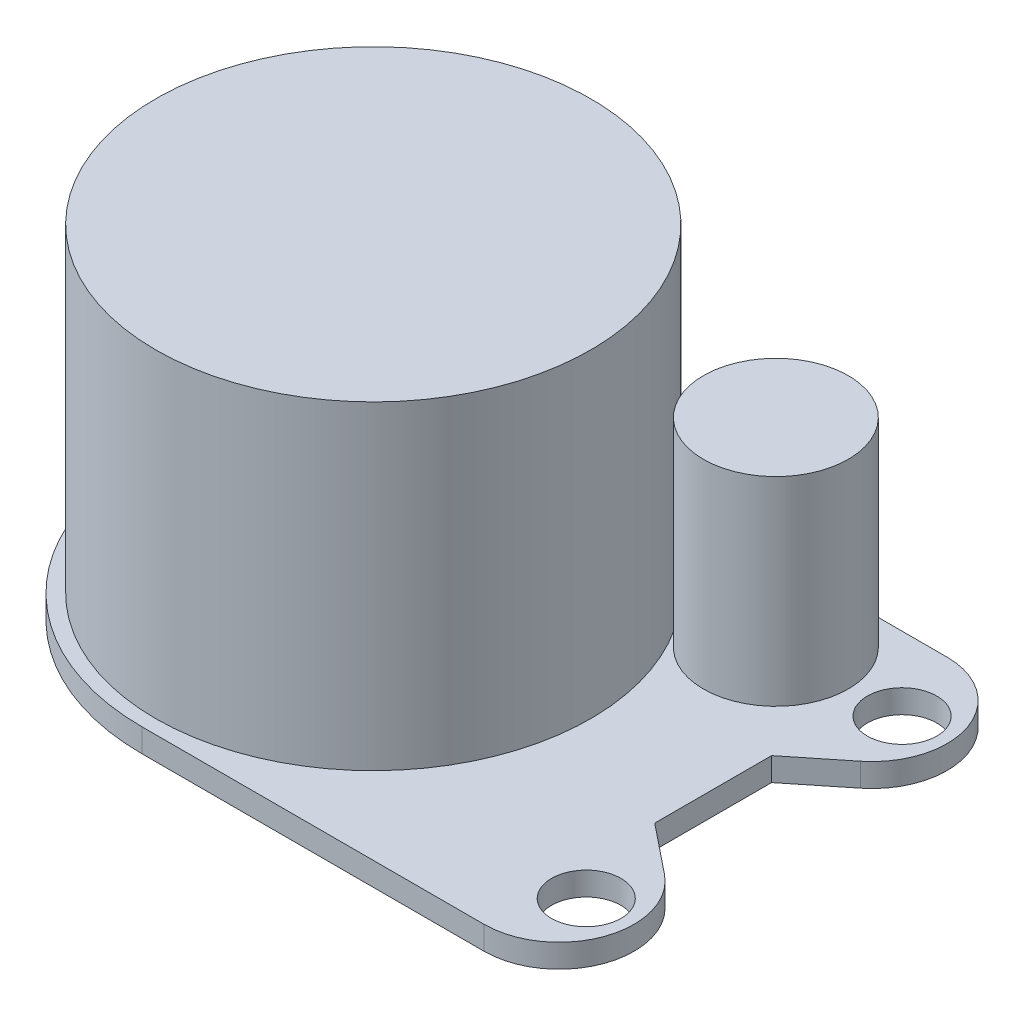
ISO-10303-21;
HEADER;
FILE_DESCRIPTION(('STEP AP214'),'2;1');
FILE_NAME('part.step','',(''),(''),'','','');
FILE_SCHEMA(('AUTOMOTIVE_DESIGN { 1 0 10303 214 1 1 1 1 }'));
ENDSEC;
DATA;
#1=APPLICATION_CONTEXT('core data for automotive mechanical design processes');
#2=APPLICATION_PROTOCOL_DEFINITION('international standard','automotive_design',2000,#1);
#3=PRODUCT_CONTEXT('',#1,'mechanical');
#4=PRODUCT('Part','Part','',(#3));
#5=PRODUCT_RELATED_PRODUCT_CATEGORY('part','',(#4));
#6=PRODUCT_DEFINITION_FORMATION('','',#4);
#7=PRODUCT_DEFINITION_CONTEXT('part definition',#1,'design');
#8=PRODUCT_DEFINITION('design','',#6,#7);
#9=PRODUCT_DEFINITION_SHAPE('','',#8);
#10=(LENGTH_UNIT() NAMED_UNIT(*) SI_UNIT(.MILLI.,.METRE.));
#11=(NAMED_UNIT(*) PLANE_ANGLE_UNIT() SI_UNIT($,.RADIAN.));
#12=(NAMED_UNIT(*) SI_UNIT($,.STERADIAN.) SOLID_ANGLE_UNIT());
#13=UNCERTAINTY_MEASURE_WITH_UNIT(LENGTH_MEASURE(1.E-05),#10,'distance_accuracy_value','');
#14=(GEOMETRIC_REPRESENTATION_CONTEXT(3) GLOBAL_UNCERTAINTY_ASSIGNED_CONTEXT((#13)) GLOBAL_UNIT_ASSIGNED_CONTEXT((#10,
#11,#12)) REPRESENTATION_CONTEXT('',''));
#15=CARTESIAN_POINT('',(0.,0.,0.));
#16=DIRECTION('',(0.,0.,1.));
#17=DIRECTION('',(1.,0.,0.));
#18=AXIS2_PLACEMENT_3D('',#15,#16,#17);
#19=CARTESIAN_POINT('',(-13.9330413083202,1.,-10.3038009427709));
#20=DIRECTION('',(0.,-1.,0.));
#21=DIRECTION('',(0.,0.,-1.));
#22=AXIS2_PLACEMENT_3D('',#19,#20,#21);
#23=CYLINDRICAL_SURFACE('',#22,3.20594155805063);
#24=CARTESIAN_POINT('',(-13.9330413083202,0.,-10.3038009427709));
#25=DIRECTION('',(0.,1.,0.));
#26=DIRECTION('',(0.,0.,1.));
#27=AXIS2_PLACEMENT_3D('',#24,#25,#26);
#28=CIRCLE('',#27,3.20594155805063);
#29=CARTESIAN_POINT('',(-11.9265456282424,0.,-7.80339370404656));
#30=VERTEX_POINT('',#29);
#31=CARTESIAN_POINT('',(-13.9330413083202,0.,-13.5097425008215));
#32=VERTEX_POINT('',#31);
#33=EDGE_CURVE('E149',#30,#32,#28,.T.);
#34=ORIENTED_EDGE('',*,*,#33,.T.);
#35=DIRECTION('',(0.,-1.,0.));
#36=VECTOR('',#35,1.);
#37=CARTESIAN_POINT('',(-13.9330413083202,1.,-13.5097425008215));
#38=LINE('',#37,#36);
#39=CARTESIAN_POINT('',(-13.9330413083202,1.,-13.5097425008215));
#40=VERTEX_POINT('',#39);
#41=EDGE_CURVE('E55',#40,#32,#38,.T.);
#42=ORIENTED_EDGE('',*,*,#41,.F.);
#43=CARTESIAN_POINT('',(-13.9330413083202,1.,-10.3038009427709));
#44=DIRECTION('',(0.,1.,0.));
#45=DIRECTION('',(0.,0.,1.));
#46=AXIS2_PLACEMENT_3D('',#43,#44,#45);
#47=CIRCLE('',#46,3.20594155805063);
#48=CARTESIAN_POINT('',(-11.9265456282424,1.,-7.80339370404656));
#49=VERTEX_POINT('',#48);
#50=EDGE_CURVE('E172',#49,#40,#47,.T.);
#51=ORIENTED_EDGE('',*,*,#50,.F.);
#52=DIRECTION('',(0.,-1.,0.));
#53=VECTOR('',#52,1.);
#54=CARTESIAN_POINT('',(-11.9265456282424,1.,-7.80339370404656));
#55=LINE('',#54,#53);
#56=EDGE_CURVE('E145',#49,#30,#55,.T.);
#57=ORIENTED_EDGE('',*,*,#56,.T.);
#58=EDGE_LOOP('',(#34,#42,#51,#57));
#59=FACE_BOUND('',#58,.T.);
#60=ADVANCED_FACE('F45',(#59),#23,.T.);
#61=CARTESIAN_POINT('',(-13.9330413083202,1.,-13.5097425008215));
#62=DIRECTION('',(0.,0.,1.));
#63=DIRECTION('',(1.,0.,0.));
#64=AXIS2_PLACEMENT_3D('',#61,#62,#63);
#65=PLANE('',#64);
#66=DIRECTION('',(-1.,0.,0.));
#67=VECTOR('',#66,1.);
#68=CARTESIAN_POINT('',(-13.9330413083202,0.,-13.5097425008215));
#69=LINE('',#68,#67);
#70=CARTESIAN_POINT('',(-28.5770997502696,0.,-13.5097425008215));
#71=VERTEX_POINT('',#70);
#72=EDGE_CURVE('E153',#32,#71,#69,.T.);
#73=ORIENTED_EDGE('',*,*,#72,.T.);
#74=DIRECTION('',(0.,-1.,0.));
#75=VECTOR('',#74,1.);
#76=CARTESIAN_POINT('',(-28.5770997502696,1.,-13.5097425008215));
#77=LINE('',#76,#75);
#78=CARTESIAN_POINT('',(-28.5770997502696,1.,-13.5097425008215));
#79=VERTEX_POINT('',#78);
#80=EDGE_CURVE('E187',#79,#71,#77,.T.);
#81=ORIENTED_EDGE('',*,*,#80,.F.);
#82=DIRECTION('',(-1.,0.,0.));
#83=VECTOR('',#82,1.);
#84=CARTESIAN_POINT('',(-13.9330413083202,1.,-13.5097425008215));
#85=LINE('',#84,#83);
#86=EDGE_CURVE('E108',#40,#79,#85,.T.);
#87=ORIENTED_EDGE('',*,*,#86,.F.);
#88=ORIENTED_EDGE('',*,*,#41,.T.);
#89=EDGE_LOOP('',(#73,#81,#87,#88));
#90=FACE_BOUND('',#89,.T.);
#91=ADVANCED_FACE('F260',(#90),#65,.F.);
#92=CARTESIAN_POINT('',(-28.5770997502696,1.,-3.60974250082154));
#93=DIRECTION('',(0.,-1.,0.));
#94=DIRECTION('',(0.,0.,-1.));
#95=AXIS2_PLACEMENT_3D('',#92,#93,#94);
#96=CYLINDRICAL_SURFACE('',#95,9.9);
#97=CARTESIAN_POINT('',(-28.5770997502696,0.,-3.60974250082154));
#98=DIRECTION('',(0.,1.,0.));
#99=DIRECTION('',(0.,0.,1.));
#100=AXIS2_PLACEMENT_3D('',#97,#98,#99);
#101=CIRCLE('',#100,9.9);
#102=CARTESIAN_POINT('',(-28.5770997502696,0.,6.29025749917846));
#103=VERTEX_POINT('',#102);
#104=EDGE_CURVE('E157',#71,#103,#101,.T.);
#105=ORIENTED_EDGE('',*,*,#104,.T.);
#106=DIRECTION('',(0.,-1.,0.));
#107=VECTOR('',#106,1.);
#108=CARTESIAN_POINT('',(-28.5770997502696,1.,6.29025749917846));
#109=LINE('',#108,#107);
#110=CARTESIAN_POINT('',(-28.5770997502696,1.,6.29025749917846));
#111=VERTEX_POINT('',#110);
#112=EDGE_CURVE('E183',#111,#103,#109,.T.);
#113=ORIENTED_EDGE('',*,*,#112,.F.);
#114=CARTESIAN_POINT('',(-28.5770997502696,1.,-3.60974250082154));
#115=DIRECTION('',(0.,1.,0.));
#116=DIRECTION('',(0.,0.,1.));
#117=AXIS2_PLACEMENT_3D('',#114,#115,#116);
#118=CIRCLE('',#117,9.9);
#119=EDGE_CURVE('E225',#79,#111,#118,.T.);
#120=ORIENTED_EDGE('',*,*,#119,.F.);
#121=ORIENTED_EDGE('',*,*,#80,.T.);
#122=EDGE_LOOP('',(#105,#113,#120,#121));
#123=FACE_BOUND('',#122,.T.);
#124=ADVANCED_FACE('F264',(#123),#96,.T.);
#125=CARTESIAN_POINT('',(-28.5770997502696,1.,6.29025749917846));
#126=DIRECTION('',(0.,0.,-1.));
#127=DIRECTION('',(-1.,0.,0.));
#128=AXIS2_PLACEMENT_3D('',#125,#126,#127);
#129=PLANE('',#128);
#130=DIRECTION('',(1.,0.,0.));
#131=VECTOR('',#130,1.);
#132=CARTESIAN_POINT('',(-28.5770997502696,0.,6.29025749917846));
#133=LINE('',#132,#131);
#134=CARTESIAN_POINT('',(-13.9330413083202,0.,6.29025749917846));
#135=VERTEX_POINT('',#134);
#136=EDGE_CURVE('E160',#103,#135,#133,.T.);
#137=ORIENTED_EDGE('',*,*,#136,.T.);
#138=DIRECTION('',(0.,-1.,0.));
#139=VECTOR('',#138,1.);
#140=CARTESIAN_POINT('',(-13.9330413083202,1.,6.29025749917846));
#141=LINE('',#140,#139);
#142=CARTESIAN_POINT('',(-13.9330413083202,1.,6.29025749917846));
#143=VERTEX_POINT('',#142);
#144=EDGE_CURVE('E179',#143,#135,#141,.T.);
#145=ORIENTED_EDGE('',*,*,#144,.F.);
#146=DIRECTION('',(1.,0.,0.));
#147=VECTOR('',#146,1.);
#148=CARTESIAN_POINT('',(-28.5770997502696,1.,6.29025749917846));
#149=LINE('',#148,#147);
#150=EDGE_CURVE('E228',#111,#143,#149,.T.);
#151=ORIENTED_EDGE('',*,*,#150,.F.);
#152=ORIENTED_EDGE('',*,*,#112,.T.);
#153=EDGE_LOOP('',(#137,#145,#151,#152));
#154=FACE_BOUND('',#153,.T.);
#155=ADVANCED_FACE('F236',(#154),#129,.F.);
#156=CARTESIAN_POINT('',(-13.9330413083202,1.,3.08431594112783));
#157=DIRECTION('',(0.,-1.,0.));
#158=DIRECTION('',(0.,0.,-1.));
#159=AXIS2_PLACEMENT_3D('',#156,#157,#158);
#160=CYLINDRICAL_SURFACE('',#159,3.20594155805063);
#161=CARTESIAN_POINT('',(-13.9330413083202,0.,3.08431594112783));
#162=DIRECTION('',(0.,1.,0.));
#163=DIRECTION('',(0.,0.,1.));
#164=AXIS2_PLACEMENT_3D('',#161,#162,#163);
#165=CIRCLE('',#164,3.20594155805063);
#166=CARTESIAN_POINT('',(-11.9265456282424,0.,0.58390870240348));
#167=VERTEX_POINT('',#166);
#168=EDGE_CURVE('E163',#135,#167,#165,.T.);
#169=ORIENTED_EDGE('',*,*,#168,.T.);
#170=DIRECTION('',(0.,-1.,0.));
#171=VECTOR('',#170,1.);
#172=CARTESIAN_POINT('',(-11.9265456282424,1.,0.58390870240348));
#173=LINE('',#172,#171);
#174=CARTESIAN_POINT('',(-11.9265456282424,1.,0.58390870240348));
#175=VERTEX_POINT('',#174);
#176=EDGE_CURVE('E138',#175,#167,#173,.T.);
#177=ORIENTED_EDGE('',*,*,#176,.F.);
#178=CARTESIAN_POINT('',(-13.9330413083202,1.,3.08431594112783));
#179=DIRECTION('',(0.,1.,0.));
#180=DIRECTION('',(0.,0.,1.));
#181=AXIS2_PLACEMENT_3D('',#178,#179,#180);
#182=CIRCLE('',#181,3.20594155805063);
#183=EDGE_CURVE('E127',#143,#175,#182,.T.);
#184=ORIENTED_EDGE('',*,*,#183,.F.);
#185=ORIENTED_EDGE('',*,*,#144,.T.);
#186=EDGE_LOOP('',(#169,#177,#184,#185));
#187=FACE_BOUND('',#186,.T.);
#188=ADVANCED_FACE('F240',(#187),#160,.T.);
#189=CARTESIAN_POINT('',(-14.0370997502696,1.,-1.10974250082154));
#190=DIRECTION('',(-0.625867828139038,0.,0.779929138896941));
#191=DIRECTION('',(0.779929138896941,0.,0.625867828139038));
#192=AXIS2_PLACEMENT_3D('',#189,#190,#191);
#193=PLANE('',#192);
#194=DIRECTION('',(-0.779929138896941,0.,-0.625867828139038));
#195=VECTOR('',#194,1.);
#196=CARTESIAN_POINT('',(-14.0370997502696,0.,-1.10974250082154));
#197=LINE('',#196,#195);
#198=CARTESIAN_POINT('',(-14.0370997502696,0.,-1.10974250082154));
#199=VERTEX_POINT('',#198);
#200=EDGE_CURVE('E136',#167,#199,#197,.T.);
#201=ORIENTED_EDGE('',*,*,#200,.T.);
#202=DIRECTION('',(0.,-1.,0.));
#203=VECTOR('',#202,1.);
#204=CARTESIAN_POINT('',(-14.0370997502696,1.,-1.10974250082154));
#205=LINE('',#204,#203);
#206=CARTESIAN_POINT('',(-14.0370997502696,1.,-1.10974250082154));
#207=VERTEX_POINT('',#206);
#208=EDGE_CURVE('E133',#207,#199,#205,.T.);
#209=ORIENTED_EDGE('',*,*,#208,.F.);
#210=DIRECTION('',(-0.779929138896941,0.,-0.625867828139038));
#211=VECTOR('',#210,1.);
#212=CARTESIAN_POINT('',(-14.0370997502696,1.,-1.10974250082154));
#213=LINE('',#212,#211);
#214=EDGE_CURVE('E121',#175,#207,#213,.T.);
#215=ORIENTED_EDGE('',*,*,#214,.F.);
#216=ORIENTED_EDGE('',*,*,#176,.T.);
#217=EDGE_LOOP('',(#201,#209,#215,#216));
#218=FACE_BOUND('',#217,.T.);
#219=ADVANCED_FACE('F134',(#218),#193,.F.);
#220=CARTESIAN_POINT('',(-14.0370997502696,1.,-6.10974250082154));
#221=DIRECTION('',(-1.,0.,0.));
#222=DIRECTION('',(0.,0.,1.));
#223=AXIS2_PLACEMENT_3D('',#220,#221,#222);
#224=PLANE('',#223);
#225=DIRECTION('',(0.,0.,-1.));
#226=VECTOR('',#225,1.);
#227=CARTESIAN_POINT('',(-14.0370997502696,0.,-6.10974250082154));
#228=LINE('',#227,#226);
#229=CARTESIAN_POINT('',(-14.0370997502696,0.,-6.10974250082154));
#230=VERTEX_POINT('',#229);
#231=EDGE_CURVE('E93',#199,#230,#228,.T.);
#232=ORIENTED_EDGE('',*,*,#231,.T.);
#233=DIRECTION('',(0.,-1.,0.));
#234=VECTOR('',#233,1.);
#235=CARTESIAN_POINT('',(-14.0370997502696,1.,-6.10974250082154));
#236=LINE('',#235,#234);
#237=CARTESIAN_POINT('',(-14.0370997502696,1.,-6.10974250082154));
#238=VERTEX_POINT('',#237);
#239=EDGE_CURVE('E139',#238,#230,#236,.T.);
#240=ORIENTED_EDGE('',*,*,#239,.F.);
#241=DIRECTION('',(0.,0.,-1.));
#242=VECTOR('',#241,1.);
#243=CARTESIAN_POINT('',(-14.0370997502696,1.,-6.10974250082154));
#244=LINE('',#243,#242);
#245=EDGE_CURVE('E125',#207,#238,#244,.T.);
#246=ORIENTED_EDGE('',*,*,#245,.F.);
#247=ORIENTED_EDGE('',*,*,#208,.T.);
#248=EDGE_LOOP('',(#232,#240,#246,#247));
#249=FACE_BOUND('',#248,.T.);
#250=ADVANCED_FACE('F141',(#249),#224,.F.);
#251=CARTESIAN_POINT('',(-14.0370997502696,1.,-6.10974250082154));
#252=DIRECTION('',(-0.625867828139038,0.,-0.779929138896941));
#253=DIRECTION('',(-0.77992913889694,0.,0.625867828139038));
#254=AXIS2_PLACEMENT_3D('',#251,#252,#253);
#255=PLANE('',#254);
#256=DIRECTION('',(0.779929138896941,0.,-0.625867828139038));
#257=VECTOR('',#256,1.);
#258=CARTESIAN_POINT('',(-14.0370997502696,0.,-6.10974250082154));
#259=LINE('',#258,#257);
#260=EDGE_CURVE('E99',#230,#30,#259,.T.);
#261=ORIENTED_EDGE('',*,*,#260,.T.);
#262=ORIENTED_EDGE('',*,*,#56,.F.);
#263=DIRECTION('',(0.779929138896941,0.,-0.625867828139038));
#264=VECTOR('',#263,1.);
#265=CARTESIAN_POINT('',(-14.0370997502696,1.,-6.10974250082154));
#266=LINE('',#265,#264);
#267=EDGE_CURVE('E64',#238,#49,#266,.T.);
#268=ORIENTED_EDGE('',*,*,#267,.F.);
#269=ORIENTED_EDGE('',*,*,#239,.T.);
#270=EDGE_LOOP('',(#261,#262,#268,#269));
#271=FACE_BOUND('',#270,.T.);
#272=ADVANCED_FACE('F248',(#271),#255,.F.);
#273=CARTESIAN_POINT('',(-13.9330413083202,1.,-10.3038009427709));
#274=DIRECTION('',(0.,1.,0.));
#275=DIRECTION('',(0.,0.,1.));
#276=AXIS2_PLACEMENT_3D('',#273,#274,#275);
#277=PLANE('',#276);
#278=CARTESIAN_POINT('',(-12.7120997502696,1.,-10.3647425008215));
#279=DIRECTION('',(0.,1.,0.));
#280=DIRECTION('',(0.,0.,1.));
#281=AXIS2_PLACEMENT_3D('',#278,#279,#280);
#282=CIRCLE('',#281,1.485);
#283=CARTESIAN_POINT('',(-12.7120997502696,1.,-8.87974250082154));
#284=VERTEX_POINT('',#283);
#285=EDGE_CURVE('E195',#284,#284,#282,.T.);
#286=ORIENTED_EDGE('',*,*,#285,.F.);
#287=EDGE_LOOP('',(#286));
#288=FACE_BOUND('',#287,.T.);
#289=CARTESIAN_POINT('',(-12.7120997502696,1.,3.14525749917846));
#290=DIRECTION('',(0.,1.,0.));
#291=DIRECTION('',(0.,0.,1.));
#292=AXIS2_PLACEMENT_3D('',#289,#290,#291);
#293=CIRCLE('',#292,1.485);
#294=CARTESIAN_POINT('',(-12.7120997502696,1.,4.63025749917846));
#295=VERTEX_POINT('',#294);
#296=EDGE_CURVE('E203',#295,#295,#293,.T.);
#297=ORIENTED_EDGE('',*,*,#296,.F.);
#298=EDGE_LOOP('',(#297));
#299=FACE_BOUND('',#298,.T.);
#300=CARTESIAN_POINT('',(-17.9626592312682,1.,-10.2157061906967));
#301=DIRECTION('',(0.,1.,0.));
#302=DIRECTION('',(0.,0.,1.));
#303=AXIS2_PLACEMENT_3D('',#300,#301,#302);
#304=CIRCLE('',#303,3.1);
#305=CARTESIAN_POINT('',(-17.9626592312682,1.,-7.11570619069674));
#306=VERTEX_POINT('',#305);
#307=EDGE_CURVE('E201',#306,#306,#304,.T.);
#308=ORIENTED_EDGE('',*,*,#307,.F.);
#309=EDGE_LOOP('',(#308));
#310=FACE_BOUND('',#309,.T.);
#311=CARTESIAN_POINT('',(-28.5770997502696,1.,-3.60974250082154));
#312=DIRECTION('',(0.,1.,0.));
#313=DIRECTION('',(0.,0.,1.));
#314=AXIS2_PLACEMENT_3D('',#311,#312,#313);
#315=CIRCLE('',#314,9.305);
#316=CARTESIAN_POINT('',(-28.5770997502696,1.,5.69525749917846));
#317=VERTEX_POINT('',#316);
#318=EDGE_CURVE('E11',#317,#317,#315,.T.);
#319=ORIENTED_EDGE('',*,*,#318,.F.);
#320=EDGE_LOOP('',(#319));
#321=FACE_BOUND('',#320,.T.);
#322=ORIENTED_EDGE('',*,*,#50,.T.);
#323=ORIENTED_EDGE('',*,*,#86,.T.);
#324=ORIENTED_EDGE('',*,*,#119,.T.);
#325=ORIENTED_EDGE('',*,*,#150,.T.);
#326=ORIENTED_EDGE('',*,*,#183,.T.);
#327=ORIENTED_EDGE('',*,*,#214,.T.);
#328=ORIENTED_EDGE('',*,*,#245,.T.);
#329=ORIENTED_EDGE('',*,*,#267,.T.);
#330=EDGE_LOOP('',(#322,#323,#324,#325,#326,#327,#328,#329));
#331=FACE_BOUND('',#330,.T.);
#332=ADVANCED_FACE('F123',(#288,#299,#310,#321,#331),#277,.T.);
#333=CARTESIAN_POINT('',(-13.9330413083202,0.,-10.3038009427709));
#334=DIRECTION('',(0.,1.,0.));
#335=DIRECTION('',(0.,0.,1.));
#336=AXIS2_PLACEMENT_3D('',#333,#334,#335);
#337=PLANE('',#336);
#338=CARTESIAN_POINT('',(-12.7120997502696,0.,-10.3647425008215));
#339=DIRECTION('',(0.,1.,0.));
#340=DIRECTION('',(0.,0.,1.));
#341=AXIS2_PLACEMENT_3D('',#338,#339,#340);
#342=CIRCLE('',#341,1.485);
#343=CARTESIAN_POINT('',(-12.7120997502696,0.,-8.87974250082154));
#344=VERTEX_POINT('',#343);
#345=EDGE_CURVE('E48',#344,#344,#342,.T.);
#346=ORIENTED_EDGE('',*,*,#345,.T.);
#347=EDGE_LOOP('',(#346));
#348=FACE_BOUND('',#347,.T.);
#349=CARTESIAN_POINT('',(-12.7120997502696,0.,3.14525749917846));
#350=DIRECTION('',(0.,1.,0.));
#351=DIRECTION('',(0.,0.,1.));
#352=AXIS2_PLACEMENT_3D('',#349,#350,#351);
#353=CIRCLE('',#352,1.485);
#354=CARTESIAN_POINT('',(-12.7120997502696,0.,4.63025749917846));
#355=VERTEX_POINT('',#354);
#356=EDGE_CURVE('E192',#355,#355,#353,.T.);
#357=ORIENTED_EDGE('',*,*,#356,.T.);
#358=EDGE_LOOP('',(#357));
#359=FACE_BOUND('',#358,.T.);
#360=ORIENTED_EDGE('',*,*,#33,.F.);
#361=ORIENTED_EDGE('',*,*,#260,.F.);
#362=ORIENTED_EDGE('',*,*,#231,.F.);
#363=ORIENTED_EDGE('',*,*,#200,.F.);
#364=ORIENTED_EDGE('',*,*,#168,.F.);
#365=ORIENTED_EDGE('',*,*,#136,.F.);
#366=ORIENTED_EDGE('',*,*,#104,.F.);
#367=ORIENTED_EDGE('',*,*,#72,.F.);
#368=EDGE_LOOP('',(#360,#361,#362,#363,#364,#365,#366,#367));
#369=FACE_BOUND('',#368,.T.);
#370=ADVANCED_FACE('F243',(#348,#359,#369),#337,.F.);
#371=CARTESIAN_POINT('',(-28.5770997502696,14.66,-3.60974250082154));
#372=DIRECTION('',(0.,-1.,0.));
#373=DIRECTION('',(0.,0.,-1.));
#374=AXIS2_PLACEMENT_3D('',#371,#372,#373);
#375=CYLINDRICAL_SURFACE('',#374,9.305);
#376=CARTESIAN_POINT('',(-28.5770997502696,14.66,-3.60974250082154));
#377=DIRECTION('',(0.,1.,0.));
#378=DIRECTION('',(0.,0.,1.));
#379=AXIS2_PLACEMENT_3D('',#376,#377,#378);
#380=CIRCLE('',#379,9.305);
#381=CARTESIAN_POINT('',(-28.5770997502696,14.66,5.69525749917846));
#382=VERTEX_POINT('',#381);
#383=EDGE_CURVE('E154',#382,#382,#380,.T.);
#384=ORIENTED_EDGE('',*,*,#383,.F.);
#385=EDGE_LOOP('',(#384));
#386=FACE_BOUND('',#385,.T.);
#387=ORIENTED_EDGE('',*,*,#318,.T.);
#388=EDGE_LOOP('',(#387));
#389=FACE_BOUND('',#388,.T.);
#390=ADVANCED_FACE('F296',(#386,#389),#375,.T.);
#391=CARTESIAN_POINT('',(-28.5770997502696,14.66,-3.60974250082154));
#392=DIRECTION('',(0.,1.,0.));
#393=DIRECTION('',(0.,0.,1.));
#394=AXIS2_PLACEMENT_3D('',#391,#392,#393);
#395=PLANE('',#394);
#396=ORIENTED_EDGE('',*,*,#383,.T.);
#397=EDGE_LOOP('',(#396));
#398=FACE_BOUND('',#397,.T.);
#399=ADVANCED_FACE('F302',(#398),#395,.T.);
#400=CARTESIAN_POINT('',(-17.9626592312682,9.51,-10.2157061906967));
#401=DIRECTION('',(0.,-1.,0.));
#402=DIRECTION('',(0.,0.,-1.));
#403=AXIS2_PLACEMENT_3D('',#400,#401,#402);
#404=CYLINDRICAL_SURFACE('',#403,3.1);
#405=CARTESIAN_POINT('',(-17.9626592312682,9.51,-10.2157061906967));
#406=DIRECTION('',(0.,1.,0.));
#407=DIRECTION('',(0.,0.,1.));
#408=AXIS2_PLACEMENT_3D('',#405,#406,#407);
#409=CIRCLE('',#408,3.1);
#410=CARTESIAN_POINT('',(-17.9626592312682,9.51,-7.11570619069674));
#411=VERTEX_POINT('',#410);
#412=EDGE_CURVE('E211',#411,#411,#409,.T.);
#413=ORIENTED_EDGE('',*,*,#412,.F.);
#414=EDGE_LOOP('',(#413));
#415=FACE_BOUND('',#414,.T.);
#416=ORIENTED_EDGE('',*,*,#307,.T.);
#417=EDGE_LOOP('',(#416));
#418=FACE_BOUND('',#417,.T.);
#419=ADVANCED_FACE('F315',(#415,#418),#404,.T.);
#420=CARTESIAN_POINT('',(-17.9626592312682,9.51,-10.2157061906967));
#421=DIRECTION('',(0.,1.,0.));
#422=DIRECTION('',(0.,0.,1.));
#423=AXIS2_PLACEMENT_3D('',#420,#421,#422);
#424=PLANE('',#423);
#425=ORIENTED_EDGE('',*,*,#412,.T.);
#426=EDGE_LOOP('',(#425));
#427=FACE_BOUND('',#426,.T.);
#428=ADVANCED_FACE('F326',(#427),#424,.T.);
#429=CARTESIAN_POINT('',(-12.7120997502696,-7.51,3.14525749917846));
#430=DIRECTION('',(0.,1.,0.));
#431=DIRECTION('',(0.,0.,1.));
#432=AXIS2_PLACEMENT_3D('',#429,#430,#431);
#433=CYLINDRICAL_SURFACE('',#432,1.485);
#434=ORIENTED_EDGE('',*,*,#296,.T.);
#435=EDGE_LOOP('',(#434));
#436=FACE_BOUND('',#435,.T.);
#437=ORIENTED_EDGE('',*,*,#356,.F.);
#438=EDGE_LOOP('',(#437));
#439=FACE_BOUND('',#438,.T.);
#440=ADVANCED_FACE('F337',(#436,#439),#433,.F.);
#441=CARTESIAN_POINT('',(-12.7120997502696,-7.51,-10.3647425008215));
#442=DIRECTION('',(0.,1.,0.));
#443=DIRECTION('',(0.,0.,1.));
#444=AXIS2_PLACEMENT_3D('',#441,#442,#443);
#445=CYLINDRICAL_SURFACE('',#444,1.485);
#446=ORIENTED_EDGE('',*,*,#285,.T.);
#447=EDGE_LOOP('',(#446));
#448=FACE_BOUND('',#447,.T.);
#449=ORIENTED_EDGE('',*,*,#345,.F.);
#450=EDGE_LOOP('',(#449));
#451=FACE_BOUND('',#450,.T.);
#452=ADVANCED_FACE('F362',(#448,#451),#445,.F.);
#453=CLOSED_SHELL('',(#60,#91,#124,#155,#188,#219,#250,#272,#332,#370,#390,#399,#419,#428,#440,#452));
#454=MANIFOLD_SOLID_BREP('B2',#453);
#455=ADVANCED_BREP_SHAPE_REPRESENTATION('',(#18,#454),#14);
#456=SHAPE_DEFINITION_REPRESENTATION(#9,#455);
ENDSEC;
END-ISO-10303-21;
